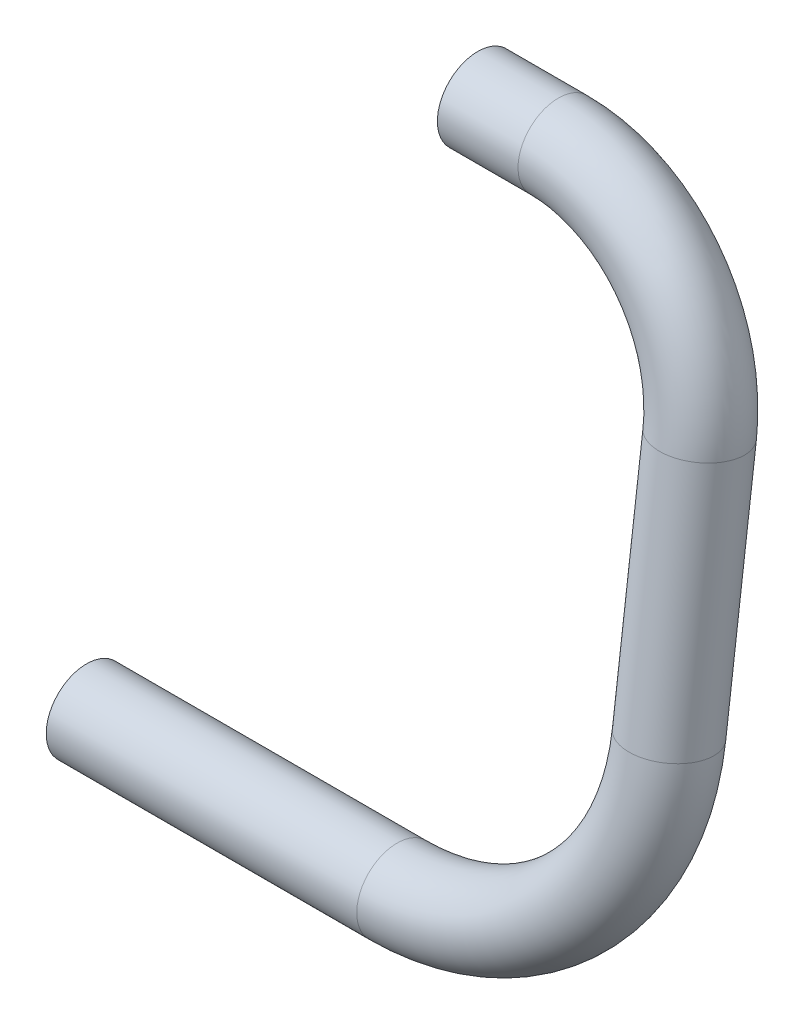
from build123d import *

# Parameters (mm, degrees)
SKETCH1_R = 3.175


with BuildPart() as part:
    # Sweep1: sweep along a curve in space
    with BuildLine() as sweep1_path:
        Line((0, 0, 0), (24.4475, 0, 0))
        ThreePointArc((24.4475, 0, 0), (37.917884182, 5.536529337, -0.692066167), (43.4975, 18.902893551, -2.362861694))
        Line((43.4975, 18.902893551, -2.362861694), (43.4975, 38.198070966, -4.774758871))
        ThreePointArc((43.4975, 38.198070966, -4.774758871), (39.777756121, 47.108980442, -5.888622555), (30.7975, 50.8, -6.35))
        Line((30.7975, 50.8, -6.35), (24.4475, 50.8, -6.35))
    # Sketch1 → Sweep1 (sweep)
    with BuildSketch(Plane(origin=(0, 0, 0), x_dir=(0, 0, -1), z_dir=(1, 0, 0))):
        Circle(SKETCH1_R)
    sweep(path=sweep1_path.line)


solid = part.part
